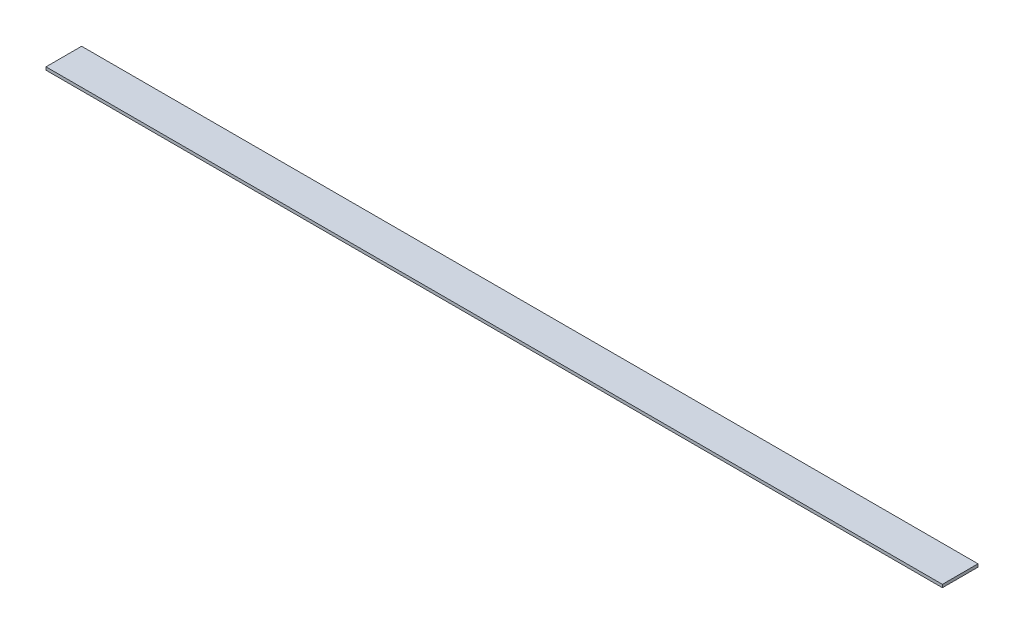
from build123d import *

# Parameters (mm, degrees)
ESQUISSE1_W        = 151
ESQUISSE1_H        = 6
BOSS_EXTRU_1_DEPTH = 0.5


with BuildPart() as part:
    # Esquisse1 → Boss.-Extru.1 (new body)
    with BuildSketch(Plane.XZ):
        Rectangle(ESQUISSE1_W, ESQUISSE1_H)
    extrude(amount=-BOSS_EXTRU_1_DEPTH)


solid = part.part
